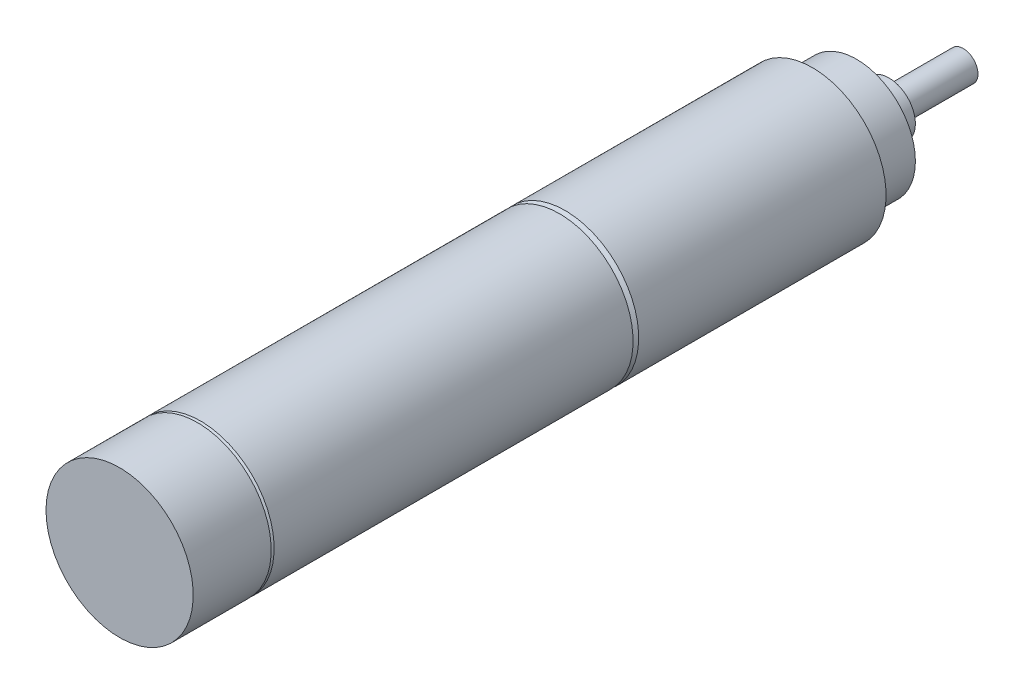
from build123d import *

# Parameters (mm, degrees)
SKETCH1_R      = 5.0038
EXTRUDE1_DEPTH = 17.1958
CHAMFER1_SIZE  = 0.381
SKETCH2_R      = 5.0038
EXTRUDE2_DEPTH = 24.6
SKETCH3_R      = 4.0005
EXTRUDE3_DEPTH = 2.9972
SKETCH5_R      = 1.0033
EXTRUDE4_DEPTH = 10.25
CHAMFER2_SIZE  = 0.2
SKETCH6_R      = 5.0038
EXTRUDE5_DEPTH = 5.3
SKETCH7_R      = 2.5
EXTRUDE6_DEPTH = 1
SKETCH8_R      = 1.8
EXTRUDE7_DEPTH = 1.2


with BuildPart() as part:
    # Sketch1 → Extrude1 (new body)
    with BuildSketch(Plane.XY):
        Circle(SKETCH1_R)
    extrude(amount=EXTRUDE1_DEPTH)

    # Chamfer1
    chamfer1_edges = [part.edges().sort_by_distance(p)[0] for p in [
        (-5.0038, 0, 17.1958),
    ]]
    chamfer(chamfer1_edges, length=CHAMFER1_SIZE)

    # Sketch2 → Extrude2 (add)
    with BuildSketch(Plane.XY.offset(17.1958)):
        Circle(SKETCH2_R)
    extrude(amount=EXTRUDE2_DEPTH)

    # Sketch3 → Extrude3 (add)
    with BuildSketch(Plane(origin=(0, 0, 0), x_dir=(-1, 0, 0), z_dir=(0, 0, -1))):
        with Locations(Location((0, 0, 0), (0, 0, 180))):
            Circle(SKETCH3_R)
    extrude(amount=EXTRUDE3_DEPTH)

    # Sketch5 → Extrude4 (add)
    with BuildSketch(Plane(origin=(0, 0, 0), x_dir=(-1, 0, 0), z_dir=(0, 0, -1))):
        Circle(SKETCH5_R)
    extrude(amount=EXTRUDE4_DEPTH)

    # Chamfer2
    chamfer2_edges = [part.edges().sort_by_distance(p)[0] for p in [
        (-5.0038, 0, 41.7958),
    ]]
    chamfer(chamfer2_edges, length=CHAMFER2_SIZE)

    # Sketch6 → Extrude5 (add)
    with BuildSketch(Plane.XY.offset(41.7958)):
        Circle(SKETCH6_R)
    extrude(amount=EXTRUDE5_DEPTH)

    # Sketch7 → Extrude6 (add)
    with BuildSketch(Plane(origin=(0, 0, -2.9972), x_dir=(-1, 0, 0), z_dir=(0, 0, -1))):
        Circle(SKETCH7_R)
    extrude(amount=EXTRUDE6_DEPTH)

    # Sketch8 → Extrude7 (add)
    with BuildSketch(Plane(origin=(0, 0, -3.9972), x_dir=(-1, 0, 0), z_dir=(0, 0, -1))):
        Circle(SKETCH8_R)
    extrude(amount=EXTRUDE7_DEPTH)


solid = part.part
